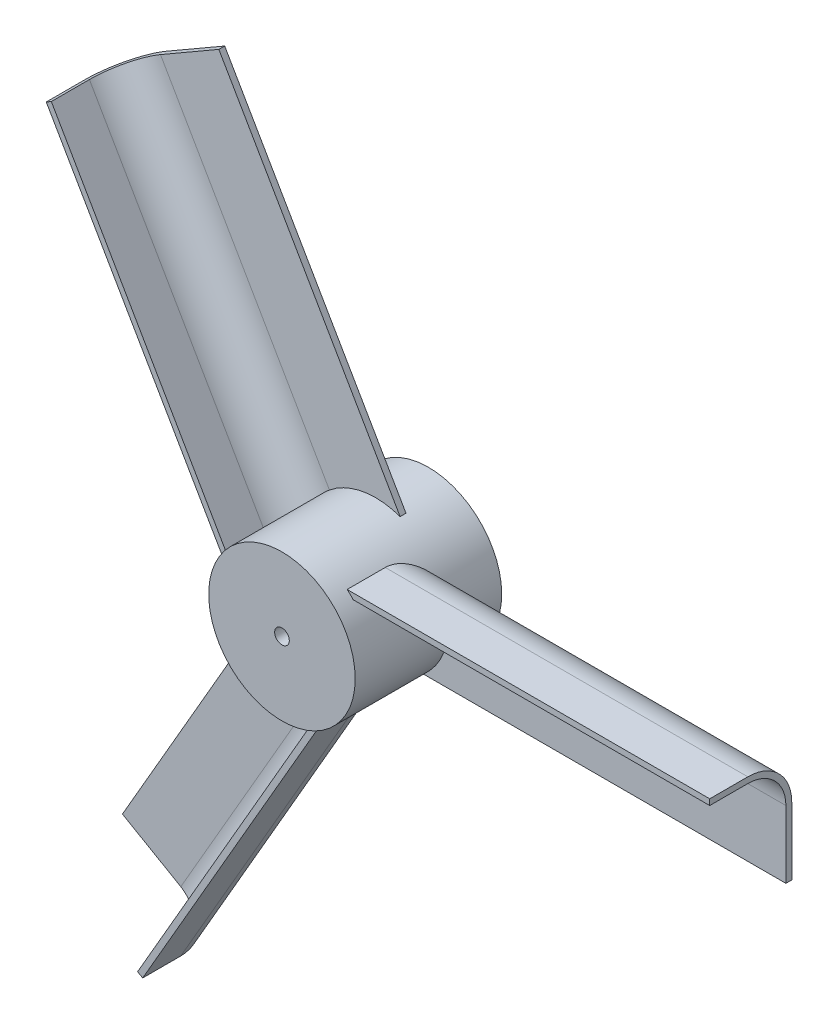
from build123d import *

# Parameters (mm, degrees)
SKETCH1_R                = 12.5
SKETCH1_R_2              = 1.25
BOSS_EXTRUDE1_DEPTH      = 25
BOSS_EXTRUDE3_REACH      = 89.106
BOSS_EXTRUDE3_END_RADIUS = 12.5
CIRPATTERN1_COUNT        = 3


with BuildPart() as part:
    # Sketch1 → Boss-Extrude1 (new body)
    with BuildSketch(Plane.XY):
        Circle(SKETCH1_R)
        Circle(SKETCH1_R_2, mode=Mode.SUBTRACT)
    extrude(amount=BOSS_EXTRUDE1_DEPTH)

    # Boss-Extrude3: up to this cylinder (the profile starts outside it)
    boss_extrude3_end = Plane(origin=(0, 0, 10.363582), z_dir=(0, 0, -1)) * Cylinder(BOSS_EXTRUDE3_END_RADIUS, 204.212, mode=Mode.PRIVATE)
    # Sketch3 → Boss-Extrude3 (add, up to the surface)
    with BuildSketch(Plane(origin=(70, 0, 0), x_dir=(0, 0, -1), z_dir=(1, 0, 0)), mode=Mode.PRIVATE) as boss_extrude3_sk1:
        with BuildLine():
            Line((-8, 2), (-8, -9.5))
            Line((-8, -9.5), (-9, -9.5))
            Line((-9, -9.5), (-9, 2))
            ThreePointArc((-9, 2), (-10.903805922, 6.596194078), (-15.5, 8.5))
            Line((-15.5, 8.5), (-22, 8.5))
            Line((-22, 8.5), (-22, 9.5))
            Line((-22, 9.5), (-15.5, 9.5))
            ThreePointArc((-15.5, 9.5), (-10.196699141, 7.303300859), (-8, 2))
        make_face()
    boss_extrude3_tool1 = extrude(boss_extrude3_sk1.sketch, amount=-BOSS_EXTRUDE3_REACH, mode=Mode.PRIVATE) - boss_extrude3_end
    boss_extrude3 = boss_extrude3_tool1.solids().sort_by_distance((70, 7.136418, 10.363582))[0]
    add(boss_extrude3)

    # CirPattern1: Boss-Extrude3 ×3 about axis
    cirpattern1_axis = Axis((0, 0, 0), (0, 0, 1))
    for i in range(1, CIRPATTERN1_COUNT):
        add(boss_extrude3.rotate(cirpattern1_axis, i * 360 / CIRPATTERN1_COUNT))


solid = part.part
